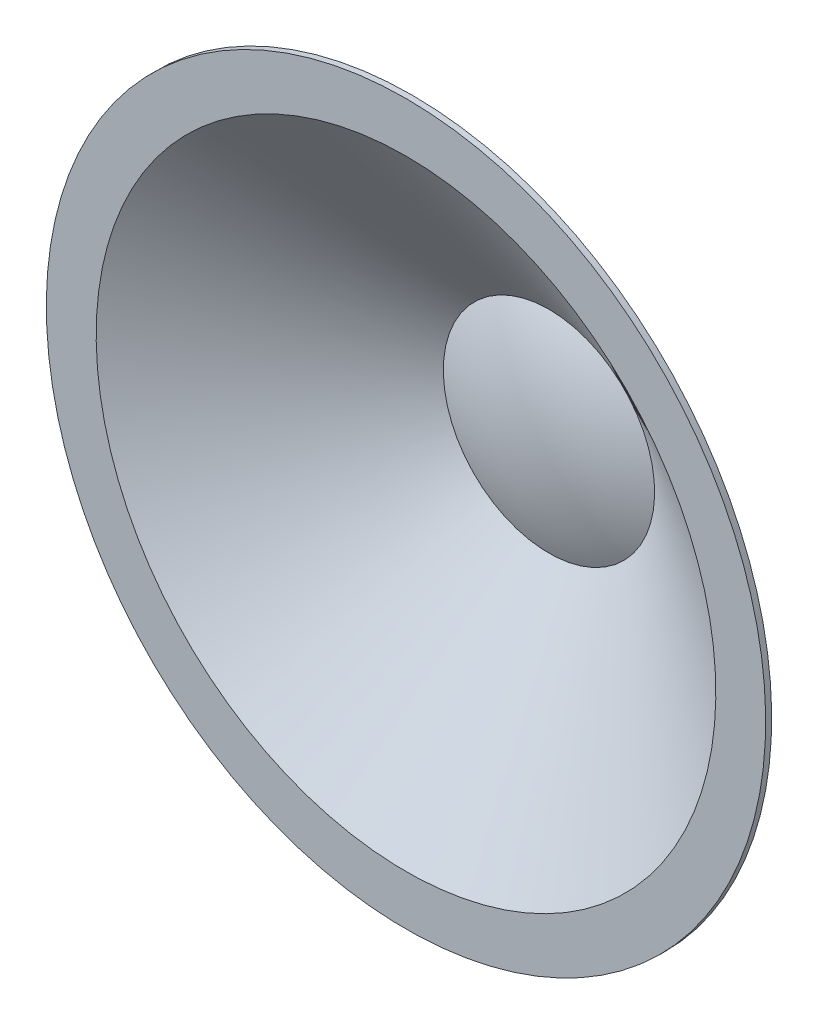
ISO-10303-21;
HEADER;
FILE_DESCRIPTION(('STEP AP214'),'2;1');
FILE_NAME('part.step','',(''),(''),'','','');
FILE_SCHEMA(('AUTOMOTIVE_DESIGN { 1 0 10303 214 1 1 1 1 }'));
ENDSEC;
DATA;
#1=APPLICATION_CONTEXT('core data for automotive mechanical design processes');
#2=APPLICATION_PROTOCOL_DEFINITION('international standard','automotive_design',2000,#1);
#3=PRODUCT_CONTEXT('',#1,'mechanical');
#4=PRODUCT('Part','Part','',(#3));
#5=PRODUCT_RELATED_PRODUCT_CATEGORY('part','',(#4));
#6=PRODUCT_DEFINITION_FORMATION('','',#4);
#7=PRODUCT_DEFINITION_CONTEXT('part definition',#1,'design');
#8=PRODUCT_DEFINITION('design','',#6,#7);
#9=PRODUCT_DEFINITION_SHAPE('','',#8);
#10=(LENGTH_UNIT() NAMED_UNIT(*) SI_UNIT(.MILLI.,.METRE.));
#11=(NAMED_UNIT(*) PLANE_ANGLE_UNIT() SI_UNIT($,.RADIAN.));
#12=(NAMED_UNIT(*) SI_UNIT($,.STERADIAN.) SOLID_ANGLE_UNIT());
#13=UNCERTAINTY_MEASURE_WITH_UNIT(LENGTH_MEASURE(1.E-05),#10,'distance_accuracy_value','');
#14=(GEOMETRIC_REPRESENTATION_CONTEXT(3) GLOBAL_UNCERTAINTY_ASSIGNED_CONTEXT((#13)) GLOBAL_UNIT_ASSIGNED_CONTEXT((#10,
#11,#12)) REPRESENTATION_CONTEXT('',''));
#15=CARTESIAN_POINT('',(0.,0.,0.));
#16=DIRECTION('',(0.,0.,1.));
#17=DIRECTION('',(1.,0.,0.));
#18=AXIS2_PLACEMENT_3D('',#15,#16,#17);
#19=CARTESIAN_POINT('',(0.,0.,-57.1509609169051));
#20=DIRECTION('',(0.,0.,-1.));
#21=DIRECTION('',(0.,1.,0.));
#22=AXIS2_PLACEMENT_3D('',#19,#20,#21);
#23=SPHERICAL_SURFACE('',#22,42.2695063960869);
#24=CARTESIAN_POINT('',(0.,0.,-18.730908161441));
#25=DIRECTION('',(0.,0.,-1.));
#26=DIRECTION('',(0.,1.,0.));
#27=AXIS2_PLACEMENT_3D('',#24,#25,#26);
#28=CIRCLE('',#27,17.6241515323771);
#29=CARTESIAN_POINT('',(0.,17.6241515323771,-18.730908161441));
#30=VERTEX_POINT('',#29);
#31=EDGE_CURVE('E62',#30,#30,#28,.T.);
#32=ORIENTED_EDGE('',*,*,#31,.F.);
#33=EDGE_LOOP('',(#32));
#34=FACE_BOUND('',#33,.T.);
#35=ADVANCED_FACE('F36',(#34),#23,.T.);
#36=CARTESIAN_POINT('',(0.,0.,-57.1509609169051));
#37=DIRECTION('',(0.,0.,-1.));
#38=DIRECTION('',(0.,1.,0.));
#39=AXIS2_PLACEMENT_3D('',#36,#37,#38);
#40=SPHERICAL_SURFACE('',#39,41.2695063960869);
#41=CARTESIAN_POINT('',(0.,0.,-19.8814545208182));
#42=DIRECTION('',(0.,0.,-1.));
#43=DIRECTION('',(0.,1.,0.));
#44=AXIS2_PLACEMENT_3D('',#41,#42,#43);
#45=CIRCLE('',#44,17.7244478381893);
#46=CARTESIAN_POINT('',(0.,17.7244478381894,-19.8814545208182));
#47=VERTEX_POINT('',#46);
#48=EDGE_CURVE('E47',#47,#47,#45,.T.);
#49=ORIENTED_EDGE('',*,*,#48,.T.);
#50=EDGE_LOOP('',(#49));
#51=FACE_BOUND('',#50,.T.);
#52=ADVANCED_FACE('F70',(#51),#40,.F.);
#53=CARTESIAN_POINT('',(0.,0.,4.11854547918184));
#54=DIRECTION('',(0.,0.,1.));
#55=DIRECTION('',(0.,-1.,0.));
#56=AXIS2_PLACEMENT_3D('',#53,#54,#55);
#57=CONICAL_SURFACE('',#56,52.,0.95993108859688);
#58=CARTESIAN_POINT('',(0.,0.,3.75684956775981));
#59=DIRECTION('',(0.,0.,1.));
#60=DIRECTION('',(0.,-1.,0.));
#61=AXIS2_PLACEMENT_3D('',#58,#59,#60);
#62=CIRCLE('',#61,51.4834447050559);
#63=CARTESIAN_POINT('',(0.,-51.4834447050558,3.75684956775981));
#64=VERTEX_POINT('',#63);
#65=EDGE_CURVE('E43',#64,#64,#62,.F.);
#66=ORIENTED_EDGE('',*,*,#65,.T.);
#67=EDGE_LOOP('',(#66));
#68=FACE_BOUND('',#67,.T.);
#69=ORIENTED_EDGE('',*,*,#48,.F.);
#70=EDGE_LOOP('',(#69));
#71=FACE_BOUND('',#70,.T.);
#72=ADVANCED_FACE('F74',(#68,#71),#57,.T.);
#73=CARTESIAN_POINT('',(0.,60.,4.11854547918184));
#74=DIRECTION('',(0.,0.,1.));
#75=DIRECTION('',(0.,-1.,0.));
#76=AXIS2_PLACEMENT_3D('',#73,#74,#75);
#77=PLANE('',#76);
#78=CARTESIAN_POINT('',(0.,0.,4.11854547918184));
#79=DIRECTION('',(0.,0.,1.));
#80=DIRECTION('',(0.,-1.,0.));
#81=AXIS2_PLACEMENT_3D('',#78,#79,#80);
#82=CIRCLE('',#81,52.630597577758);
#83=CARTESIAN_POINT('',(0.,-52.6305975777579,4.11854547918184));
#84=VERTEX_POINT('',#83);
#85=EDGE_CURVE('E10',#84,#84,#82,.T.);
#86=ORIENTED_EDGE('',*,*,#85,.T.);
#87=EDGE_LOOP('',(#86));
#88=FACE_BOUND('',#87,.T.);
#89=CARTESIAN_POINT('',(0.,0.,4.11854547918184));
#90=DIRECTION('',(0.,0.,-1.));
#91=DIRECTION('',(0.,1.,0.));
#92=AXIS2_PLACEMENT_3D('',#89,#90,#91);
#93=CIRCLE('',#92,60.);
#94=CARTESIAN_POINT('',(0.,60.,4.11854547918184));
#95=VERTEX_POINT('',#94);
#96=EDGE_CURVE('E51',#95,#95,#93,.T.);
#97=ORIENTED_EDGE('',*,*,#96,.T.);
#98=EDGE_LOOP('',(#97));
#99=FACE_BOUND('',#98,.T.);
#100=ADVANCED_FACE('F80',(#88,#99),#77,.F.);
#101=CARTESIAN_POINT('',(0.,0.,-19.8814545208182));
#102=DIRECTION('',(0.,0.,-1.));
#103=DIRECTION('',(0.,1.,0.));
#104=AXIS2_PLACEMENT_3D('',#101,#102,#103);
#105=CYLINDRICAL_SURFACE('',#104,60.);
#106=ORIENTED_EDGE('',*,*,#96,.F.);
#107=EDGE_LOOP('',(#106));
#108=FACE_BOUND('',#107,.T.);
#109=CARTESIAN_POINT('',(0.,0.,5.11854547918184));
#110=DIRECTION('',(0.,0.,-1.));
#111=DIRECTION('',(0.,1.,0.));
#112=AXIS2_PLACEMENT_3D('',#109,#110,#111);
#113=CIRCLE('',#112,60.);
#114=CARTESIAN_POINT('',(0.,60.,5.11854547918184));
#115=VERTEX_POINT('',#114);
#116=EDGE_CURVE('E56',#115,#115,#113,.T.);
#117=ORIENTED_EDGE('',*,*,#116,.T.);
#118=EDGE_LOOP('',(#117));
#119=FACE_BOUND('',#118,.T.);
#120=ADVANCED_FACE('F83',(#108,#119),#105,.T.);
#121=CARTESIAN_POINT('',(0.,60.,5.11854547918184));
#122=DIRECTION('',(0.,0.,1.));
#123=DIRECTION('',(0.,-1.,0.));
#124=AXIS2_PLACEMENT_3D('',#121,#122,#123);
#125=PLANE('',#124);
#126=CARTESIAN_POINT('',(0.,0.,5.11854547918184));
#127=DIRECTION('',(0.,0.,-1.));
#128=DIRECTION('',(0.,1.,0.));
#129=AXIS2_PLACEMENT_3D('',#126,#127,#128);
#130=CIRCLE('',#129,51.684701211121);
#131=CARTESIAN_POINT('',(0.,51.6847012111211,5.11854547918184));
#132=VERTEX_POINT('',#131);
#133=EDGE_CURVE('E59',#132,#132,#130,.T.);
#134=ORIENTED_EDGE('',*,*,#133,.T.);
#135=EDGE_LOOP('',(#134));
#136=FACE_BOUND('',#135,.T.);
#137=ORIENTED_EDGE('',*,*,#116,.F.);
#138=EDGE_LOOP('',(#137));
#139=FACE_BOUND('',#138,.T.);
#140=ADVANCED_FACE('F86',(#136,#139),#125,.T.);
#141=CARTESIAN_POINT('',(0.,0.,5.11854547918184));
#142=DIRECTION('',(0.,0.,1.));
#143=DIRECTION('',(0.,-1.,0.));
#144=AXIS2_PLACEMENT_3D('',#141,#142,#143);
#145=CONICAL_SURFACE('',#144,51.684701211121,0.95993108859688);
#146=ORIENTED_EDGE('',*,*,#31,.T.);
#147=EDGE_LOOP('',(#146));
#148=FACE_BOUND('',#147,.T.);
#149=ORIENTED_EDGE('',*,*,#133,.F.);
#150=EDGE_LOOP('',(#149));
#151=FACE_BOUND('',#150,.T.);
#152=ADVANCED_FACE('F66',(#148,#151),#145,.F.);
#153=CARTESIAN_POINT('',(0.,0.,2.11854547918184));
#154=DIRECTION('',(0.,0.,1.));
#155=DIRECTION('',(0.,-1.,0.));
#156=AXIS2_PLACEMENT_3D('',#153,#154,#155);
#157=TOROIDAL_SURFACE('',#156,52.630597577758,2.);
#158=ORIENTED_EDGE('',*,*,#85,.F.);
#159=EDGE_LOOP('',(#158));
#160=FACE_BOUND('',#159,.T.);
#161=ORIENTED_EDGE('',*,*,#65,.F.);
#162=EDGE_LOOP('',(#161));
#163=FACE_BOUND('',#162,.T.);
#164=ADVANCED_FACE('F38',(#160,#163),#157,.F.);
#165=CLOSED_SHELL('',(#35,#52,#72,#100,#120,#140,#152,#164));
#166=MANIFOLD_SOLID_BREP('B2',#165);
#167=ADVANCED_BREP_SHAPE_REPRESENTATION('',(#18,#166),#14);
#168=SHAPE_DEFINITION_REPRESENTATION(#9,#167);
ENDSEC;
END-ISO-10303-21;
